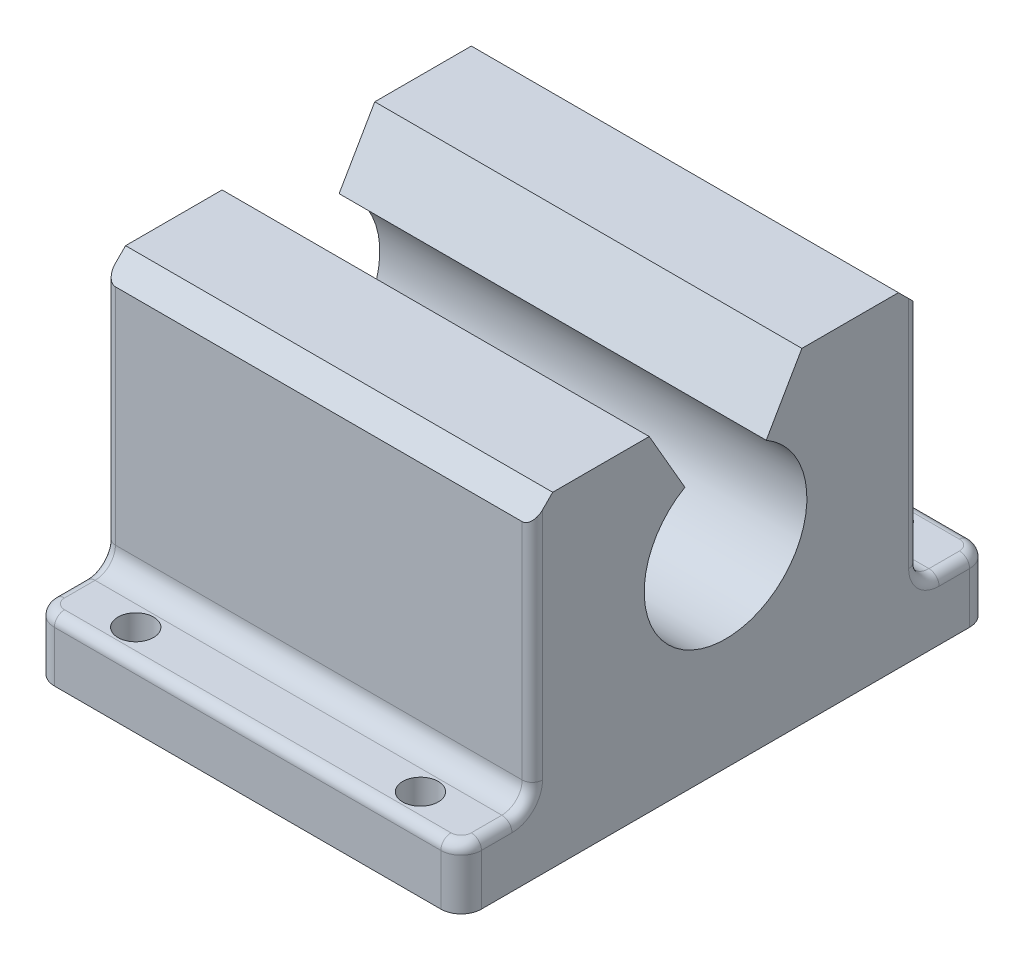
ISO-10303-21;
HEADER;
FILE_DESCRIPTION(('STEP AP214'),'2;1');
FILE_NAME('part.step','',(''),(''),'','','');
FILE_SCHEMA(('AUTOMOTIVE_DESIGN { 1 0 10303 214 1 1 1 1 }'));
ENDSEC;
DATA;
#1=APPLICATION_CONTEXT('core data for automotive mechanical design processes');
#2=APPLICATION_PROTOCOL_DEFINITION('international standard','automotive_design',2000,#1);
#3=PRODUCT_CONTEXT('',#1,'mechanical');
#4=PRODUCT('Part','Part','',(#3));
#5=PRODUCT_RELATED_PRODUCT_CATEGORY('part','',(#4));
#6=PRODUCT_DEFINITION_FORMATION('','',#4);
#7=PRODUCT_DEFINITION_CONTEXT('part definition',#1,'design');
#8=PRODUCT_DEFINITION('design','',#6,#7);
#9=PRODUCT_DEFINITION_SHAPE('','',#8);
#10=(LENGTH_UNIT() NAMED_UNIT(*) SI_UNIT(.MILLI.,.METRE.));
#11=(NAMED_UNIT(*) PLANE_ANGLE_UNIT() SI_UNIT($,.RADIAN.));
#12=(NAMED_UNIT(*) SI_UNIT($,.STERADIAN.) SOLID_ANGLE_UNIT());
#13=UNCERTAINTY_MEASURE_WITH_UNIT(LENGTH_MEASURE(1.E-05),#10,'distance_accuracy_value','');
#14=(GEOMETRIC_REPRESENTATION_CONTEXT(3) GLOBAL_UNCERTAINTY_ASSIGNED_CONTEXT((#13)) GLOBAL_UNIT_ASSIGNED_CONTEXT((#10,
#11,#12)) REPRESENTATION_CONTEXT('',''));
#15=CARTESIAN_POINT('',(0.,0.,0.));
#16=DIRECTION('',(0.,0.,1.));
#17=DIRECTION('',(1.,0.,0.));
#18=AXIS2_PLACEMENT_3D('',#15,#16,#17);
#19=CARTESIAN_POINT('',(66.675,50.8,30.1625));
#20=DIRECTION('',(0.,1.,0.));
#21=DIRECTION('',(0.,0.,1.));
#22=AXIS2_PLACEMENT_3D('',#19,#20,#21);
#23=PLANE('',#22);
#24=DIRECTION('',(0.,0.,-1.));
#25=VECTOR('',#24,1.);
#26=CARTESIAN_POINT('',(66.675,50.8,30.1625));
#27=LINE('',#26,#25);
#28=CARTESIAN_POINT('',(66.675,50.8,-11.9150661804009));
#29=VERTEX_POINT('',#28);
#30=CARTESIAN_POINT('',(66.675,50.8,-26.9874999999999));
#31=VERTEX_POINT('',#30);
#32=EDGE_CURVE('E242',#29,#31,#27,.T.);
#33=ORIENTED_EDGE('',*,*,#32,.T.);
#34=DIRECTION('',(-1.,0.,0.));
#35=VECTOR('',#34,1.);
#36=CARTESIAN_POINT('',(0.,50.8,-26.9874999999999));
#37=LINE('',#36,#35);
#38=CARTESIAN_POINT('',(0.,50.8,-26.9874999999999));
#39=VERTEX_POINT('',#38);
#40=EDGE_CURVE('E285',#31,#39,#37,.T.);
#41=ORIENTED_EDGE('',*,*,#40,.T.);
#42=DIRECTION('',(0.,0.,-1.));
#43=VECTOR('',#42,1.);
#44=CARTESIAN_POINT('',(0.,50.8,30.1625));
#45=LINE('',#44,#43);
#46=CARTESIAN_POINT('',(0.,50.8,-11.9150661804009));
#47=VERTEX_POINT('',#46);
#48=EDGE_CURVE('E245',#47,#39,#45,.T.);
#49=ORIENTED_EDGE('',*,*,#48,.F.);
#50=DIRECTION('',(1.,0.,0.));
#51=VECTOR('',#50,1.);
#52=CARTESIAN_POINT('',(0.,50.8,-11.9150661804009));
#53=LINE('',#52,#51);
#54=EDGE_CURVE('E228',#47,#29,#53,.T.);
#55=ORIENTED_EDGE('',*,*,#54,.T.);
#56=EDGE_LOOP('',(#33,#41,#49,#55));
#57=FACE_BOUND('',#56,.T.);
#58=ADVANCED_FACE('F31',(#57),#23,.T.);
#59=CARTESIAN_POINT('',(66.675,50.8,-41.275));
#60=DIRECTION('',(-1.,0.,0.));
#61=DIRECTION('',(0.,0.,1.));
#62=AXIS2_PLACEMENT_3D('',#59,#60,#61);
#63=PLANE('',#62);
#64=CARTESIAN_POINT('',(66.675,12.7,33.3375));
#65=DIRECTION('',(-1.,0.,0.));
#66=DIRECTION('',(0.,0.,1.));
#67=AXIS2_PLACEMENT_3D('',#64,#65,#66);
#68=CIRCLE('',#67,4.7625);
#69=CARTESIAN_POINT('',(66.675,12.7,28.575));
#70=VERTEX_POINT('',#69);
#71=CARTESIAN_POINT('',(66.675,7.9375,33.3375));
#72=VERTEX_POINT('',#71);
#73=EDGE_CURVE('E39',#70,#72,#68,.T.);
#74=ORIENTED_EDGE('',*,*,#73,.T.);
#75=DIRECTION('',(0.,0.,-1.));
#76=VECTOR('',#75,1.);
#77=CARTESIAN_POINT('',(66.675,7.9375,38.1));
#78=LINE('',#77,#76);
#79=CARTESIAN_POINT('',(66.675,7.9375,38.1));
#80=VERTEX_POINT('',#79);
#81=EDGE_CURVE('E11',#72,#80,#78,.F.);
#82=ORIENTED_EDGE('',*,*,#81,.T.);
#83=DIRECTION('',(0.,1.,0.));
#84=VECTOR('',#83,1.);
#85=CARTESIAN_POINT('',(66.675,0.,38.1));
#86=LINE('',#85,#84);
#87=CARTESIAN_POINT('',(66.675,0.,38.1));
#88=VERTEX_POINT('',#87);
#89=EDGE_CURVE('E325',#80,#88,#86,.F.);
#90=ORIENTED_EDGE('',*,*,#89,.T.);
#91=DIRECTION('',(0.,0.,-1.));
#92=VECTOR('',#91,1.);
#93=CARTESIAN_POINT('',(66.675,0.,41.275));
#94=LINE('',#93,#92);
#95=CARTESIAN_POINT('',(66.675,0.,-38.1));
#96=VERTEX_POINT('',#95);
#97=EDGE_CURVE('E255',#88,#96,#94,.T.);
#98=ORIENTED_EDGE('',*,*,#97,.T.);
#99=DIRECTION('',(0.,1.,0.));
#100=VECTOR('',#99,1.);
#101=CARTESIAN_POINT('',(66.675,50.8,-38.1));
#102=LINE('',#101,#100);
#103=CARTESIAN_POINT('',(66.675,7.9375,-38.1));
#104=VERTEX_POINT('',#103);
#105=EDGE_CURVE('E327',#96,#104,#102,.T.);
#106=ORIENTED_EDGE('',*,*,#105,.T.);
#107=DIRECTION('',(0.,0.,1.));
#108=VECTOR('',#107,1.);
#109=CARTESIAN_POINT('',(66.675,7.9375,-41.275));
#110=LINE('',#109,#108);
#111=CARTESIAN_POINT('',(66.675,7.9375,-33.3375));
#112=VERTEX_POINT('',#111);
#113=EDGE_CURVE('E404',#104,#112,#110,.T.);
#114=ORIENTED_EDGE('',*,*,#113,.T.);
#115=CARTESIAN_POINT('',(66.675,12.7,-33.3375));
#116=DIRECTION('',(-1.,0.,0.));
#117=DIRECTION('',(0.,0.,1.));
#118=AXIS2_PLACEMENT_3D('',#115,#116,#117);
#119=CIRCLE('',#118,4.7625);
#120=CARTESIAN_POINT('',(66.675,12.7,-28.575));
#121=VERTEX_POINT('',#120);
#122=EDGE_CURVE('E402',#112,#121,#119,.T.);
#123=ORIENTED_EDGE('',*,*,#122,.T.);
#124=DIRECTION('',(0.,1.,0.));
#125=VECTOR('',#124,1.);
#126=CARTESIAN_POINT('',(66.675,50.8,-28.575));
#127=LINE('',#126,#125);
#128=CARTESIAN_POINT('',(66.675,49.2125,-28.575));
#129=VERTEX_POINT('',#128);
#130=EDGE_CURVE('E400',#121,#129,#127,.T.);
#131=ORIENTED_EDGE('',*,*,#130,.T.);
#132=DIRECTION('',(0.,0.707106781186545,0.707106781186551));
#133=VECTOR('',#132,1.);
#134=CARTESIAN_POINT('',(66.675,50.8,-26.9874999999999));
#135=LINE('',#134,#133);
#136=EDGE_CURVE('E251',#129,#31,#135,.T.);
#137=ORIENTED_EDGE('',*,*,#136,.T.);
#138=ORIENTED_EDGE('',*,*,#32,.F.);
#139=DIRECTION('',(0.,-0.866025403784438,0.500000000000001));
#140=VECTOR('',#139,1.);
#141=CARTESIAN_POINT('',(66.675,50.8,-11.9150661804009));
#142=LINE('',#141,#140);
#143=CARTESIAN_POINT('',(66.675,41.1610226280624,-6.35000000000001));
#144=VERTEX_POINT('',#143);
#145=EDGE_CURVE('E225',#29,#144,#142,.T.);
#146=ORIENTED_EDGE('',*,*,#145,.T.);
#147=CARTESIAN_POINT('',(66.675,30.1625,0.));
#148=DIRECTION('',(1.,0.,0.));
#149=DIRECTION('',(0.,0.,-1.));
#150=AXIS2_PLACEMENT_3D('',#147,#148,#149);
#151=CIRCLE('',#150,12.7);
#152=CARTESIAN_POINT('',(66.675,41.1610226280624,6.35000000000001));
#153=VERTEX_POINT('',#152);
#154=EDGE_CURVE('E488',#153,#144,#151,.T.);
#155=ORIENTED_EDGE('',*,*,#154,.F.);
#156=DIRECTION('',(0.,-0.866025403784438,-0.500000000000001));
#157=VECTOR('',#156,1.);
#158=CARTESIAN_POINT('',(66.675,50.8,11.9150661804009));
#159=LINE('',#158,#157);
#160=CARTESIAN_POINT('',(66.675,50.8,11.9150661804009));
#161=VERTEX_POINT('',#160);
#162=EDGE_CURVE('E236',#161,#153,#159,.T.);
#163=ORIENTED_EDGE('',*,*,#162,.F.);
#164=CARTESIAN_POINT('',(66.675,50.8,26.9875));
#165=VERTEX_POINT('',#164);
#166=EDGE_CURVE('E252',#165,#161,#27,.T.);
#167=ORIENTED_EDGE('',*,*,#166,.F.);
#168=DIRECTION('',(0.,0.707106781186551,-0.707106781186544));
#169=VECTOR('',#168,1.);
#170=CARTESIAN_POINT('',(66.675,47.6249999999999,30.1625));
#171=LINE('',#170,#169);
#172=CARTESIAN_POINT('',(66.675,49.2125,28.575));
#173=VERTEX_POINT('',#172);
#174=EDGE_CURVE('E283',#165,#173,#171,.F.);
#175=ORIENTED_EDGE('',*,*,#174,.T.);
#176=DIRECTION('',(0.,1.,0.));
#177=VECTOR('',#176,1.);
#178=CARTESIAN_POINT('',(66.675,12.7,28.575));
#179=LINE('',#178,#177);
#180=EDGE_CURVE('E49',#173,#70,#179,.F.);
#181=ORIENTED_EDGE('',*,*,#180,.T.);
#182=EDGE_LOOP('',(#74,#82,#90,#98,#106,#114,#123,#131,#137,#138,#146,#155,#163,#167,#175,#181));
#183=FACE_BOUND('',#182,.T.);
#184=ADVANCED_FACE('F249',(#183),#63,.F.);
#185=CARTESIAN_POINT('',(0.,50.8,-41.275));
#186=DIRECTION('',(-1.,0.,0.));
#187=DIRECTION('',(0.,0.,1.));
#188=AXIS2_PLACEMENT_3D('',#185,#186,#187);
#189=PLANE('',#188);
#190=CARTESIAN_POINT('',(0.,12.7,33.3375));
#191=DIRECTION('',(-1.,0.,0.));
#192=DIRECTION('',(0.,0.,1.));
#193=AXIS2_PLACEMENT_3D('',#190,#191,#192);
#194=CIRCLE('',#193,4.7625);
#195=CARTESIAN_POINT('',(0.,7.93750000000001,33.3375));
#196=VERTEX_POINT('',#195);
#197=CARTESIAN_POINT('',(0.,12.7,28.575));
#198=VERTEX_POINT('',#197);
#199=EDGE_CURVE('E338',#196,#198,#194,.F.);
#200=ORIENTED_EDGE('',*,*,#199,.T.);
#201=DIRECTION('',(0.,1.,0.));
#202=VECTOR('',#201,1.);
#203=CARTESIAN_POINT('',(0.,50.8,28.575));
#204=LINE('',#203,#202);
#205=CARTESIAN_POINT('',(0.,49.2125,28.575));
#206=VERTEX_POINT('',#205);
#207=EDGE_CURVE('E340',#198,#206,#204,.T.);
#208=ORIENTED_EDGE('',*,*,#207,.T.);
#209=DIRECTION('',(0.,-0.707106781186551,0.707106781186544));
#210=VECTOR('',#209,1.);
#211=CARTESIAN_POINT('',(0.,84.93125,-7.14374999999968));
#212=LINE('',#211,#210);
#213=CARTESIAN_POINT('',(0.,50.8,26.9875));
#214=VERTEX_POINT('',#213);
#215=EDGE_CURVE('E278',#206,#214,#212,.F.);
#216=ORIENTED_EDGE('',*,*,#215,.T.);
#217=CARTESIAN_POINT('',(0.,50.8,11.9150661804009));
#218=VERTEX_POINT('',#217);
#219=EDGE_CURVE('E257',#214,#218,#45,.T.);
#220=ORIENTED_EDGE('',*,*,#219,.T.);
#221=DIRECTION('',(0.,-0.866025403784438,-0.500000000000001));
#222=VECTOR('',#221,1.);
#223=CARTESIAN_POINT('',(0.,50.8,11.9150661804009));
#224=LINE('',#223,#222);
#225=CARTESIAN_POINT('',(0.,41.1610226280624,6.35000000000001));
#226=VERTEX_POINT('',#225);
#227=EDGE_CURVE('E235',#218,#226,#224,.T.);
#228=ORIENTED_EDGE('',*,*,#227,.T.);
#229=CARTESIAN_POINT('',(0.,30.1625,0.));
#230=DIRECTION('',(1.,0.,0.));
#231=DIRECTION('',(0.,0.,-1.));
#232=AXIS2_PLACEMENT_3D('',#229,#230,#231);
#233=CIRCLE('',#232,12.7);
#234=CARTESIAN_POINT('',(0.,41.1610226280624,-6.35000000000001));
#235=VERTEX_POINT('',#234);
#236=EDGE_CURVE('E485',#226,#235,#233,.T.);
#237=ORIENTED_EDGE('',*,*,#236,.T.);
#238=DIRECTION('',(0.,-0.866025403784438,0.500000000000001));
#239=VECTOR('',#238,1.);
#240=CARTESIAN_POINT('',(0.,50.8,-11.9150661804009));
#241=LINE('',#240,#239);
#242=EDGE_CURVE('E247',#47,#235,#241,.T.);
#243=ORIENTED_EDGE('',*,*,#242,.F.);
#244=ORIENTED_EDGE('',*,*,#48,.T.);
#245=DIRECTION('',(0.,-0.707106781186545,-0.707106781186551));
#246=VECTOR('',#245,1.);
#247=CARTESIAN_POINT('',(0.,43.65625,-34.13125));
#248=LINE('',#247,#246);
#249=CARTESIAN_POINT('',(0.,49.2125,-28.575));
#250=VERTEX_POINT('',#249);
#251=EDGE_CURVE('E275',#39,#250,#248,.T.);
#252=ORIENTED_EDGE('',*,*,#251,.T.);
#253=DIRECTION('',(0.,1.,0.));
#254=VECTOR('',#253,1.);
#255=CARTESIAN_POINT('',(0.,12.7,-28.575));
#256=LINE('',#255,#254);
#257=CARTESIAN_POINT('',(0.,12.7,-28.575));
#258=VERTEX_POINT('',#257);
#259=EDGE_CURVE('E334',#250,#258,#256,.F.);
#260=ORIENTED_EDGE('',*,*,#259,.T.);
#261=CARTESIAN_POINT('',(0.,12.7,-33.3375));
#262=DIRECTION('',(-1.,0.,0.));
#263=DIRECTION('',(0.,0.,1.));
#264=AXIS2_PLACEMENT_3D('',#261,#262,#263);
#265=CIRCLE('',#264,4.7625);
#266=CARTESIAN_POINT('',(0.,7.9375,-33.3375));
#267=VERTEX_POINT('',#266);
#268=EDGE_CURVE('E332',#258,#267,#265,.F.);
#269=ORIENTED_EDGE('',*,*,#268,.T.);
#270=DIRECTION('',(0.,0.,1.));
#271=VECTOR('',#270,1.);
#272=CARTESIAN_POINT('',(0.,7.9375,-38.1));
#273=LINE('',#272,#271);
#274=CARTESIAN_POINT('',(0.,7.9375,-38.1));
#275=VERTEX_POINT('',#274);
#276=EDGE_CURVE('E330',#267,#275,#273,.F.);
#277=ORIENTED_EDGE('',*,*,#276,.T.);
#278=DIRECTION('',(0.,1.,0.));
#279=VECTOR('',#278,1.);
#280=CARTESIAN_POINT('',(0.,0.,-38.1));
#281=LINE('',#280,#279);
#282=CARTESIAN_POINT('',(0.,0.,-38.1));
#283=VERTEX_POINT('',#282);
#284=EDGE_CURVE('E302',#275,#283,#281,.F.);
#285=ORIENTED_EDGE('',*,*,#284,.T.);
#286=DIRECTION('',(0.,0.,-1.));
#287=VECTOR('',#286,1.);
#288=CARTESIAN_POINT('',(0.,0.,41.275));
#289=LINE('',#288,#287);
#290=CARTESIAN_POINT('',(0.,0.,38.1));
#291=VERTEX_POINT('',#290);
#292=EDGE_CURVE('E253',#291,#283,#289,.T.);
#293=ORIENTED_EDGE('',*,*,#292,.F.);
#294=DIRECTION('',(0.,1.,0.));
#295=VECTOR('',#294,1.);
#296=CARTESIAN_POINT('',(0.,50.8,38.1));
#297=LINE('',#296,#295);
#298=CARTESIAN_POINT('',(0.,7.9375,38.1));
#299=VERTEX_POINT('',#298);
#300=EDGE_CURVE('E304',#291,#299,#297,.T.);
#301=ORIENTED_EDGE('',*,*,#300,.T.);
#302=DIRECTION('',(0.,0.,-1.));
#303=VECTOR('',#302,1.);
#304=CARTESIAN_POINT('',(0.,7.93750000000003,-41.275));
#305=LINE('',#304,#303);
#306=EDGE_CURVE('E336',#299,#196,#305,.T.);
#307=ORIENTED_EDGE('',*,*,#306,.T.);
#308=EDGE_LOOP('',(#200,#208,#216,#220,#228,#237,#243,#244,#252,#260,#269,#277,#285,#293,#301,#307));
#309=FACE_BOUND('',#308,.T.);
#310=ADVANCED_FACE('F492',(#309),#189,.T.);
#311=CARTESIAN_POINT('',(66.675,0.,-41.275));
#312=DIRECTION('',(0.,0.,1.));
#313=DIRECTION('',(1.,0.,0.));
#314=AXIS2_PLACEMENT_3D('',#311,#312,#313);
#315=PLANE('',#314);
#316=DIRECTION('',(0.,1.,0.));
#317=VECTOR('',#316,1.);
#318=CARTESIAN_POINT('',(3.175,9.525,-41.275));
#319=LINE('',#318,#317);
#320=CARTESIAN_POINT('',(3.175,0.,-41.275));
#321=VERTEX_POINT('',#320);
#322=CARTESIAN_POINT('',(3.175,7.9375,-41.275));
#323=VERTEX_POINT('',#322);
#324=EDGE_CURVE('E322',#321,#323,#319,.T.);
#325=ORIENTED_EDGE('',*,*,#324,.T.);
#326=DIRECTION('',(-1.,0.,0.));
#327=VECTOR('',#326,1.);
#328=CARTESIAN_POINT('',(66.675,7.9375,-41.275));
#329=LINE('',#328,#327);
#330=CARTESIAN_POINT('',(63.5,7.9375,-41.275));
#331=VERTEX_POINT('',#330);
#332=EDGE_CURVE('E394',#323,#331,#329,.F.);
#333=ORIENTED_EDGE('',*,*,#332,.T.);
#334=DIRECTION('',(0.,1.,0.));
#335=VECTOR('',#334,1.);
#336=CARTESIAN_POINT('',(63.5,0.,-41.275));
#337=LINE('',#336,#335);
#338=CARTESIAN_POINT('',(63.5,0.,-41.275));
#339=VERTEX_POINT('',#338);
#340=EDGE_CURVE('E320',#331,#339,#337,.F.);
#341=ORIENTED_EDGE('',*,*,#340,.T.);
#342=DIRECTION('',(-1.,0.,0.));
#343=VECTOR('',#342,1.);
#344=CARTESIAN_POINT('',(66.675,0.,-41.275));
#345=LINE('',#344,#343);
#346=EDGE_CURVE('E263',#339,#321,#345,.T.);
#347=ORIENTED_EDGE('',*,*,#346,.T.);
#348=EDGE_LOOP('',(#325,#333,#341,#347));
#349=FACE_BOUND('',#348,.T.);
#350=ADVANCED_FACE('F33',(#349),#315,.F.);
#351=CARTESIAN_POINT('',(66.675,9.525,-41.275));
#352=DIRECTION('',(0.,-1.,0.));
#353=DIRECTION('',(0.,0.,-1.));
#354=AXIS2_PLACEMENT_3D('',#351,#352,#353);
#355=PLANE('',#354);
#356=CARTESIAN_POINT('',(11.1125,9.525,-36.5125));
#357=DIRECTION('',(0.,1.,0.));
#358=DIRECTION('',(0.,0.,1.));
#359=AXIS2_PLACEMENT_3D('',#356,#357,#358);
#360=CIRCLE('',#359,2.778125);
#361=CARTESIAN_POINT('',(11.1125,9.525,-33.734375));
#362=VERTEX_POINT('',#361);
#363=EDGE_CURVE('E460',#362,#362,#360,.T.);
#364=ORIENTED_EDGE('',*,*,#363,.F.);
#365=EDGE_LOOP('',(#364));
#366=FACE_BOUND('',#365,.T.);
#367=CARTESIAN_POINT('',(55.5625,9.525,-36.5125));
#368=DIRECTION('',(0.,1.,0.));
#369=DIRECTION('',(0.,0.,1.));
#370=AXIS2_PLACEMENT_3D('',#367,#368,#369);
#371=CIRCLE('',#370,2.778125);
#372=CARTESIAN_POINT('',(55.5625,9.525,-33.734375));
#373=VERTEX_POINT('',#372);
#374=EDGE_CURVE('E473',#373,#373,#371,.T.);
#375=ORIENTED_EDGE('',*,*,#374,.F.);
#376=EDGE_LOOP('',(#375));
#377=FACE_BOUND('',#376,.T.);
#378=CARTESIAN_POINT('',(3.175,9.525,-38.1));
#379=DIRECTION('',(0.,-1.,0.));
#380=DIRECTION('',(0.,0.,-1.));
#381=AXIS2_PLACEMENT_3D('',#378,#379,#380);
#382=CIRCLE('',#381,1.5875);
#383=CARTESIAN_POINT('',(3.175,9.525,-39.6875));
#384=VERTEX_POINT('',#383);
#385=CARTESIAN_POINT('',(1.5875,9.525,-38.1));
#386=VERTEX_POINT('',#385);
#387=EDGE_CURVE('E384',#384,#386,#382,.F.);
#388=ORIENTED_EDGE('',*,*,#387,.T.);
#389=DIRECTION('',(0.,0.,1.));
#390=VECTOR('',#389,1.);
#391=CARTESIAN_POINT('',(1.58750000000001,9.525,-33.3375));
#392=LINE('',#391,#390);
#393=CARTESIAN_POINT('',(1.58750000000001,9.525,-33.3375));
#394=VERTEX_POINT('',#393);
#395=EDGE_CURVE('E386',#386,#394,#392,.T.);
#396=ORIENTED_EDGE('',*,*,#395,.T.);
#397=DIRECTION('',(-1.,0.,0.));
#398=VECTOR('',#397,1.);
#399=CARTESIAN_POINT('',(66.675,9.525,-33.3375));
#400=LINE('',#399,#398);
#401=CARTESIAN_POINT('',(65.0875,9.525,-33.3375));
#402=VERTEX_POINT('',#401);
#403=EDGE_CURVE('E293',#394,#402,#400,.F.);
#404=ORIENTED_EDGE('',*,*,#403,.T.);
#405=DIRECTION('',(0.,0.,1.));
#406=VECTOR('',#405,1.);
#407=CARTESIAN_POINT('',(65.0875,9.525,-41.275));
#408=LINE('',#407,#406);
#409=CARTESIAN_POINT('',(65.0875,9.525,-38.1));
#410=VERTEX_POINT('',#409);
#411=EDGE_CURVE('E378',#402,#410,#408,.F.);
#412=ORIENTED_EDGE('',*,*,#411,.T.);
#413=CARTESIAN_POINT('',(63.5,9.525,-38.1));
#414=DIRECTION('',(0.,-1.,0.));
#415=DIRECTION('',(0.,0.,-1.));
#416=AXIS2_PLACEMENT_3D('',#413,#414,#415);
#417=CIRCLE('',#416,1.5875);
#418=CARTESIAN_POINT('',(63.5,9.525,-39.6875));
#419=VERTEX_POINT('',#418);
#420=EDGE_CURVE('E380',#410,#419,#417,.F.);
#421=ORIENTED_EDGE('',*,*,#420,.T.);
#422=DIRECTION('',(-1.,0.,0.));
#423=VECTOR('',#422,1.);
#424=CARTESIAN_POINT('',(66.675,9.525,-39.6875));
#425=LINE('',#424,#423);
#426=EDGE_CURVE('E382',#419,#384,#425,.T.);
#427=ORIENTED_EDGE('',*,*,#426,.T.);
#428=EDGE_LOOP('',(#388,#396,#404,#412,#421,#427));
#429=FACE_BOUND('',#428,.T.);
#430=ADVANCED_FACE('F606',(#366,#377,#429),#355,.F.);
#431=CARTESIAN_POINT('',(66.675,9.525,-30.1625));
#432=DIRECTION('',(0.,0.,1.));
#433=DIRECTION('',(1.,0.,0.));
#434=AXIS2_PLACEMENT_3D('',#431,#432,#433);
#435=PLANE('',#434);
#436=DIRECTION('',(-1.,0.,0.));
#437=VECTOR('',#436,1.);
#438=CARTESIAN_POINT('',(0.,12.7,-30.1625));
#439=LINE('',#438,#437);
#440=CARTESIAN_POINT('',(65.0875,12.7,-30.1625));
#441=VERTEX_POINT('',#440);
#442=CARTESIAN_POINT('',(1.5875,12.7,-30.1625));
#443=VERTEX_POINT('',#442);
#444=EDGE_CURVE('E290',#441,#443,#439,.T.);
#445=ORIENTED_EDGE('',*,*,#444,.T.);
#446=DIRECTION('',(0.,1.,0.));
#447=VECTOR('',#446,1.);
#448=CARTESIAN_POINT('',(1.58750000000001,47.625,-30.1625));
#449=LINE('',#448,#447);
#450=CARTESIAN_POINT('',(1.58750000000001,47.625,-30.1625));
#451=VERTEX_POINT('',#450);
#452=EDGE_CURVE('E353',#443,#451,#449,.T.);
#453=ORIENTED_EDGE('',*,*,#452,.T.);
#454=DIRECTION('',(1.,0.,0.));
#455=VECTOR('',#454,1.);
#456=CARTESIAN_POINT('',(66.675,47.625,-30.1625));
#457=LINE('',#456,#455);
#458=CARTESIAN_POINT('',(65.0875,47.625,-30.1625));
#459=VERTEX_POINT('',#458);
#460=EDGE_CURVE('E287',#451,#459,#457,.T.);
#461=ORIENTED_EDGE('',*,*,#460,.T.);
#462=DIRECTION('',(0.,1.,0.));
#463=VECTOR('',#462,1.);
#464=CARTESIAN_POINT('',(65.0875,9.525,-30.1625));
#465=LINE('',#464,#463);
#466=EDGE_CURVE('E351',#459,#441,#465,.F.);
#467=ORIENTED_EDGE('',*,*,#466,.T.);
#468=EDGE_LOOP('',(#445,#453,#461,#467));
#469=FACE_BOUND('',#468,.T.);
#470=ADVANCED_FACE('F618',(#469),#435,.F.);
#471=ORIENTED_EDGE('',*,*,#219,.F.);
#472=DIRECTION('',(1.,0.,0.));
#473=VECTOR('',#472,1.);
#474=CARTESIAN_POINT('',(66.675,50.8,26.9875));
#475=LINE('',#474,#473);
#476=EDGE_CURVE('E280',#214,#165,#475,.T.);
#477=ORIENTED_EDGE('',*,*,#476,.T.);
#478=ORIENTED_EDGE('',*,*,#166,.T.);
#479=DIRECTION('',(1.,0.,0.));
#480=VECTOR('',#479,1.);
#481=CARTESIAN_POINT('',(0.,50.8,11.9150661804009));
#482=LINE('',#481,#480);
#483=EDGE_CURVE('E246',#218,#161,#482,.T.);
#484=ORIENTED_EDGE('',*,*,#483,.F.);
#485=EDGE_LOOP('',(#471,#477,#478,#484));
#486=FACE_BOUND('',#485,.T.);
#487=ADVANCED_FACE('F505',(#486),#23,.T.);
#488=CARTESIAN_POINT('',(66.675,9.525,30.1625));
#489=DIRECTION('',(0.,0.,1.));
#490=DIRECTION('',(1.,0.,0.));
#491=AXIS2_PLACEMENT_3D('',#488,#489,#490);
#492=PLANE('',#491);
#493=DIRECTION('',(-1.,0.,0.));
#494=VECTOR('',#493,1.);
#495=CARTESIAN_POINT('',(66.675,47.6249999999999,30.1625));
#496=LINE('',#495,#494);
#497=CARTESIAN_POINT('',(65.0875,47.6249999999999,30.1625));
#498=VERTEX_POINT('',#497);
#499=CARTESIAN_POINT('',(1.5875,47.6249999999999,30.1625));
#500=VERTEX_POINT('',#499);
#501=EDGE_CURVE('E272',#498,#500,#496,.T.);
#502=ORIENTED_EDGE('',*,*,#501,.T.);
#503=DIRECTION('',(0.,1.,0.));
#504=VECTOR('',#503,1.);
#505=CARTESIAN_POINT('',(1.58750000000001,9.525,30.1625));
#506=LINE('',#505,#504);
#507=CARTESIAN_POINT('',(1.5875,12.7,30.1625));
#508=VERTEX_POINT('',#507);
#509=EDGE_CURVE('E349',#500,#508,#506,.F.);
#510=ORIENTED_EDGE('',*,*,#509,.T.);
#511=DIRECTION('',(-1.,0.,0.));
#512=VECTOR('',#511,1.);
#513=CARTESIAN_POINT('',(66.675,12.7,30.1625));
#514=LINE('',#513,#512);
#515=CARTESIAN_POINT('',(65.0875,12.7,30.1625));
#516=VERTEX_POINT('',#515);
#517=EDGE_CURVE('E299',#508,#516,#514,.F.);
#518=ORIENTED_EDGE('',*,*,#517,.T.);
#519=DIRECTION('',(0.,1.,0.));
#520=VECTOR('',#519,1.);
#521=CARTESIAN_POINT('',(65.0875,47.6249999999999,30.1625));
#522=LINE('',#521,#520);
#523=EDGE_CURVE('E347',#516,#498,#522,.T.);
#524=ORIENTED_EDGE('',*,*,#523,.T.);
#525=EDGE_LOOP('',(#502,#510,#518,#524));
#526=FACE_BOUND('',#525,.T.);
#527=ADVANCED_FACE('F625',(#526),#492,.T.);
#528=CARTESIAN_POINT('',(66.675,9.525,41.275));
#529=DIRECTION('',(0.,1.,0.));
#530=DIRECTION('',(0.,0.,1.));
#531=AXIS2_PLACEMENT_3D('',#528,#529,#530);
#532=PLANE('',#531);
#533=CARTESIAN_POINT('',(11.1125,9.525,36.5125));
#534=DIRECTION('',(0.,1.,0.));
#535=DIRECTION('',(0.,0.,1.));
#536=AXIS2_PLACEMENT_3D('',#533,#534,#535);
#537=CIRCLE('',#536,2.778125);
#538=CARTESIAN_POINT('',(11.1125,9.525,39.290625));
#539=VERTEX_POINT('',#538);
#540=EDGE_CURVE('E467',#539,#539,#537,.T.);
#541=ORIENTED_EDGE('',*,*,#540,.F.);
#542=EDGE_LOOP('',(#541));
#543=FACE_BOUND('',#542,.T.);
#544=CARTESIAN_POINT('',(55.5625,9.525,36.5125));
#545=DIRECTION('',(0.,1.,0.));
#546=DIRECTION('',(0.,0.,1.));
#547=AXIS2_PLACEMENT_3D('',#544,#545,#546);
#548=CIRCLE('',#547,2.778125);
#549=CARTESIAN_POINT('',(55.5625,9.525,39.290625));
#550=VERTEX_POINT('',#549);
#551=EDGE_CURVE('E479',#550,#550,#548,.T.);
#552=ORIENTED_EDGE('',*,*,#551,.F.);
#553=EDGE_LOOP('',(#552));
#554=FACE_BOUND('',#553,.T.);
#555=DIRECTION('',(-1.,0.,0.));
#556=VECTOR('',#555,1.);
#557=CARTESIAN_POINT('',(0.,9.525,33.3375));
#558=LINE('',#557,#556);
#559=CARTESIAN_POINT('',(65.0875,9.525,33.3375));
#560=VERTEX_POINT('',#559);
#561=CARTESIAN_POINT('',(1.5875,9.525,33.3375));
#562=VERTEX_POINT('',#561);
#563=EDGE_CURVE('E296',#560,#562,#558,.T.);
#564=ORIENTED_EDGE('',*,*,#563,.T.);
#565=DIRECTION('',(0.,0.,-1.));
#566=VECTOR('',#565,1.);
#567=CARTESIAN_POINT('',(1.58750000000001,9.525,41.275));
#568=LINE('',#567,#566);
#569=CARTESIAN_POINT('',(1.5875,9.525,38.1));
#570=VERTEX_POINT('',#569);
#571=EDGE_CURVE('E376',#562,#570,#568,.F.);
#572=ORIENTED_EDGE('',*,*,#571,.T.);
#573=CARTESIAN_POINT('',(3.175,9.525,38.1));
#574=DIRECTION('',(0.,1.,0.));
#575=DIRECTION('',(0.,0.,1.));
#576=AXIS2_PLACEMENT_3D('',#573,#574,#575);
#577=CIRCLE('',#576,1.5875);
#578=CARTESIAN_POINT('',(3.175,9.525,39.6875));
#579=VERTEX_POINT('',#578);
#580=EDGE_CURVE('E374',#570,#579,#577,.T.);
#581=ORIENTED_EDGE('',*,*,#580,.T.);
#582=DIRECTION('',(-1.,0.,0.));
#583=VECTOR('',#582,1.);
#584=CARTESIAN_POINT('',(66.675,9.525,39.6875));
#585=LINE('',#584,#583);
#586=CARTESIAN_POINT('',(63.5,9.525,39.6875));
#587=VERTEX_POINT('',#586);
#588=EDGE_CURVE('E372',#579,#587,#585,.F.);
#589=ORIENTED_EDGE('',*,*,#588,.T.);
#590=CARTESIAN_POINT('',(63.5,9.525,38.1));
#591=DIRECTION('',(0.,1.,0.));
#592=DIRECTION('',(0.,0.,1.));
#593=AXIS2_PLACEMENT_3D('',#590,#591,#592);
#594=CIRCLE('',#593,1.5875);
#595=CARTESIAN_POINT('',(65.0875,9.525,38.1));
#596=VERTEX_POINT('',#595);
#597=EDGE_CURVE('E370',#587,#596,#594,.T.);
#598=ORIENTED_EDGE('',*,*,#597,.T.);
#599=DIRECTION('',(0.,0.,-1.));
#600=VECTOR('',#599,1.);
#601=CARTESIAN_POINT('',(65.0875,9.525,33.3375));
#602=LINE('',#601,#600);
#603=EDGE_CURVE('E368',#596,#560,#602,.T.);
#604=ORIENTED_EDGE('',*,*,#603,.T.);
#605=EDGE_LOOP('',(#564,#572,#581,#589,#598,#604));
#606=FACE_BOUND('',#605,.T.);
#607=ADVANCED_FACE('F636',(#543,#554,#606),#532,.T.);
#608=CARTESIAN_POINT('',(66.675,0.,41.275));
#609=DIRECTION('',(0.,0.,1.));
#610=DIRECTION('',(1.,0.,0.));
#611=AXIS2_PLACEMENT_3D('',#608,#609,#610);
#612=PLANE('',#611);
#613=DIRECTION('',(0.,1.,0.));
#614=VECTOR('',#613,1.);
#615=CARTESIAN_POINT('',(63.5,9.525,41.275));
#616=LINE('',#615,#614);
#617=CARTESIAN_POINT('',(63.5,0.,41.275));
#618=VERTEX_POINT('',#617);
#619=CARTESIAN_POINT('',(63.5,7.9375,41.275));
#620=VERTEX_POINT('',#619);
#621=EDGE_CURVE('E307',#618,#620,#616,.T.);
#622=ORIENTED_EDGE('',*,*,#621,.T.);
#623=DIRECTION('',(-1.,0.,0.));
#624=VECTOR('',#623,1.);
#625=CARTESIAN_POINT('',(66.675,7.9375,41.275));
#626=LINE('',#625,#624);
#627=CARTESIAN_POINT('',(3.175,7.9375,41.275));
#628=VERTEX_POINT('',#627);
#629=EDGE_CURVE('E392',#620,#628,#626,.T.);
#630=ORIENTED_EDGE('',*,*,#629,.T.);
#631=DIRECTION('',(0.,1.,0.));
#632=VECTOR('',#631,1.);
#633=CARTESIAN_POINT('',(3.175,0.,41.275));
#634=LINE('',#633,#632);
#635=CARTESIAN_POINT('',(3.175,0.,41.275));
#636=VERTEX_POINT('',#635);
#637=EDGE_CURVE('E310',#628,#636,#634,.F.);
#638=ORIENTED_EDGE('',*,*,#637,.T.);
#639=DIRECTION('',(-1.,0.,0.));
#640=VECTOR('',#639,1.);
#641=CARTESIAN_POINT('',(66.675,0.,41.275));
#642=LINE('',#641,#640);
#643=EDGE_CURVE('E266',#618,#636,#642,.T.);
#644=ORIENTED_EDGE('',*,*,#643,.F.);
#645=EDGE_LOOP('',(#622,#630,#638,#644));
#646=FACE_BOUND('',#645,.T.);
#647=ADVANCED_FACE('F535',(#646),#612,.T.);
#648=CARTESIAN_POINT('',(66.675,0.,41.275));
#649=DIRECTION('',(0.,1.,0.));
#650=DIRECTION('',(0.,0.,1.));
#651=AXIS2_PLACEMENT_3D('',#648,#649,#650);
#652=PLANE('',#651);
#653=CARTESIAN_POINT('',(11.1125,0.,-36.5125));
#654=DIRECTION('',(0.,1.,0.));
#655=DIRECTION('',(0.,0.,1.));
#656=AXIS2_PLACEMENT_3D('',#653,#654,#655);
#657=CIRCLE('',#656,2.778125);
#658=CARTESIAN_POINT('',(11.1125,0.,-33.734375));
#659=VERTEX_POINT('',#658);
#660=EDGE_CURVE('E464',#659,#659,#657,.T.);
#661=ORIENTED_EDGE('',*,*,#660,.T.);
#662=EDGE_LOOP('',(#661));
#663=FACE_BOUND('',#662,.T.);
#664=CARTESIAN_POINT('',(11.1125,0.,36.5125));
#665=DIRECTION('',(0.,1.,0.));
#666=DIRECTION('',(0.,0.,1.));
#667=AXIS2_PLACEMENT_3D('',#664,#665,#666);
#668=CIRCLE('',#667,2.778125);
#669=CARTESIAN_POINT('',(11.1125,0.,39.290625));
#670=VERTEX_POINT('',#669);
#671=EDGE_CURVE('E470',#670,#670,#668,.T.);
#672=ORIENTED_EDGE('',*,*,#671,.T.);
#673=EDGE_LOOP('',(#672));
#674=FACE_BOUND('',#673,.T.);
#675=CARTESIAN_POINT('',(55.5625,0.,-36.5125));
#676=DIRECTION('',(0.,1.,0.));
#677=DIRECTION('',(0.,0.,1.));
#678=AXIS2_PLACEMENT_3D('',#675,#676,#677);
#679=CIRCLE('',#678,2.778125);
#680=CARTESIAN_POINT('',(55.5625,0.,-33.734375));
#681=VERTEX_POINT('',#680);
#682=EDGE_CURVE('E476',#681,#681,#679,.T.);
#683=ORIENTED_EDGE('',*,*,#682,.T.);
#684=EDGE_LOOP('',(#683));
#685=FACE_BOUND('',#684,.T.);
#686=CARTESIAN_POINT('',(55.5625,0.,36.5125));
#687=DIRECTION('',(0.,1.,0.));
#688=DIRECTION('',(0.,0.,1.));
#689=AXIS2_PLACEMENT_3D('',#686,#687,#688);
#690=CIRCLE('',#689,2.778125);
#691=CARTESIAN_POINT('',(55.5625,0.,39.290625));
#692=VERTEX_POINT('',#691);
#693=EDGE_CURVE('E482',#692,#692,#690,.T.);
#694=ORIENTED_EDGE('',*,*,#693,.T.);
#695=EDGE_LOOP('',(#694));
#696=FACE_BOUND('',#695,.T.);
#697=ORIENTED_EDGE('',*,*,#643,.T.);
#698=CARTESIAN_POINT('',(3.175,0.,38.1));
#699=DIRECTION('',(0.,1.,0.));
#700=DIRECTION('',(0.,0.,1.));
#701=AXIS2_PLACEMENT_3D('',#698,#699,#700);
#702=CIRCLE('',#701,3.175);
#703=EDGE_CURVE('E318',#636,#291,#702,.F.);
#704=ORIENTED_EDGE('',*,*,#703,.T.);
#705=ORIENTED_EDGE('',*,*,#292,.T.);
#706=CARTESIAN_POINT('',(3.175,0.,-38.1));
#707=DIRECTION('',(0.,1.,0.));
#708=DIRECTION('',(0.,0.,1.));
#709=AXIS2_PLACEMENT_3D('',#706,#707,#708);
#710=CIRCLE('',#709,3.175);
#711=EDGE_CURVE('E316',#283,#321,#710,.F.);
#712=ORIENTED_EDGE('',*,*,#711,.T.);
#713=ORIENTED_EDGE('',*,*,#346,.F.);
#714=CARTESIAN_POINT('',(63.5,0.,-38.1));
#715=DIRECTION('',(0.,1.,0.));
#716=DIRECTION('',(0.,0.,1.));
#717=AXIS2_PLACEMENT_3D('',#714,#715,#716);
#718=CIRCLE('',#717,3.175);
#719=EDGE_CURVE('E314',#339,#96,#718,.F.);
#720=ORIENTED_EDGE('',*,*,#719,.T.);
#721=ORIENTED_EDGE('',*,*,#97,.F.);
#722=CARTESIAN_POINT('',(63.5,0.,38.1));
#723=DIRECTION('',(0.,1.,0.));
#724=DIRECTION('',(0.,0.,1.));
#725=AXIS2_PLACEMENT_3D('',#722,#723,#724);
#726=CIRCLE('',#725,3.175);
#727=EDGE_CURVE('E312',#88,#618,#726,.F.);
#728=ORIENTED_EDGE('',*,*,#727,.T.);
#729=EDGE_LOOP('',(#697,#704,#705,#712,#713,#720,#721,#728));
#730=FACE_BOUND('',#729,.T.);
#731=ADVANCED_FACE('F532',(#663,#674,#685,#696,#730),#652,.F.);
#732=CARTESIAN_POINT('',(66.675,30.1625,0.));
#733=DIRECTION('',(-1.,0.,0.));
#734=DIRECTION('',(0.,0.,1.));
#735=AXIS2_PLACEMENT_3D('',#732,#733,#734);
#736=CYLINDRICAL_SURFACE('',#735,12.7);
#737=DIRECTION('',(-1.,0.,0.));
#738=VECTOR('',#737,1.);
#739=CARTESIAN_POINT('',(66.675,41.1610226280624,6.35000000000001));
#740=LINE('',#739,#738);
#741=EDGE_CURVE('E270',#153,#226,#740,.T.);
#742=ORIENTED_EDGE('',*,*,#741,.F.);
#743=ORIENTED_EDGE('',*,*,#154,.T.);
#744=DIRECTION('',(-1.,0.,0.));
#745=VECTOR('',#744,1.);
#746=CARTESIAN_POINT('',(66.675,41.1610226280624,-6.35000000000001));
#747=LINE('',#746,#745);
#748=EDGE_CURVE('E231',#144,#235,#747,.T.);
#749=ORIENTED_EDGE('',*,*,#748,.T.);
#750=ORIENTED_EDGE('',*,*,#236,.F.);
#751=EDGE_LOOP('',(#742,#743,#749,#750));
#752=FACE_BOUND('',#751,.T.);
#753=ADVANCED_FACE('F497',(#752),#736,.F.);
#754=CARTESIAN_POINT('',(55.5625,0.,36.5125));
#755=DIRECTION('',(0.,1.,0.));
#756=DIRECTION('',(0.,0.,1.));
#757=AXIS2_PLACEMENT_3D('',#754,#755,#756);
#758=CYLINDRICAL_SURFACE('',#757,2.778125);
#759=ORIENTED_EDGE('',*,*,#693,.F.);
#760=EDGE_LOOP('',(#759));
#761=FACE_BOUND('',#760,.T.);
#762=ORIENTED_EDGE('',*,*,#551,.T.);
#763=EDGE_LOOP('',(#762));
#764=FACE_BOUND('',#763,.T.);
#765=ADVANCED_FACE('F650',(#761,#764),#758,.F.);
#766=CARTESIAN_POINT('',(55.5625,0.,-36.5125));
#767=DIRECTION('',(0.,1.,0.));
#768=DIRECTION('',(0.,0.,1.));
#769=AXIS2_PLACEMENT_3D('',#766,#767,#768);
#770=CYLINDRICAL_SURFACE('',#769,2.778125);
#771=ORIENTED_EDGE('',*,*,#682,.F.);
#772=EDGE_LOOP('',(#771));
#773=FACE_BOUND('',#772,.T.);
#774=ORIENTED_EDGE('',*,*,#374,.T.);
#775=EDGE_LOOP('',(#774));
#776=FACE_BOUND('',#775,.T.);
#777=ADVANCED_FACE('F653',(#773,#776),#770,.F.);
#778=CARTESIAN_POINT('',(11.1125,0.,36.5125));
#779=DIRECTION('',(0.,1.,0.));
#780=DIRECTION('',(0.,0.,1.));
#781=AXIS2_PLACEMENT_3D('',#778,#779,#780);
#782=CYLINDRICAL_SURFACE('',#781,2.778125);
#783=ORIENTED_EDGE('',*,*,#671,.F.);
#784=EDGE_LOOP('',(#783));
#785=FACE_BOUND('',#784,.T.);
#786=ORIENTED_EDGE('',*,*,#540,.T.);
#787=EDGE_LOOP('',(#786));
#788=FACE_BOUND('',#787,.T.);
#789=ADVANCED_FACE('F657',(#785,#788),#782,.F.);
#790=CARTESIAN_POINT('',(11.1125,0.,-36.5125));
#791=DIRECTION('',(0.,1.,0.));
#792=DIRECTION('',(0.,0.,1.));
#793=AXIS2_PLACEMENT_3D('',#790,#791,#792);
#794=CYLINDRICAL_SURFACE('',#793,2.778125);
#795=ORIENTED_EDGE('',*,*,#660,.F.);
#796=EDGE_LOOP('',(#795));
#797=FACE_BOUND('',#796,.T.);
#798=ORIENTED_EDGE('',*,*,#363,.T.);
#799=EDGE_LOOP('',(#798));
#800=FACE_BOUND('',#799,.T.);
#801=ADVANCED_FACE('F661',(#797,#800),#794,.F.);
#802=CARTESIAN_POINT('',(0.,50.8,-11.9150661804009));
#803=DIRECTION('',(0.,0.500000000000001,0.866025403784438));
#804=DIRECTION('',(0.,-0.866025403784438,0.500000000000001));
#805=AXIS2_PLACEMENT_3D('',#802,#803,#804);
#806=PLANE('',#805);
#807=ORIENTED_EDGE('',*,*,#145,.F.);
#808=ORIENTED_EDGE('',*,*,#54,.F.);
#809=ORIENTED_EDGE('',*,*,#242,.T.);
#810=ORIENTED_EDGE('',*,*,#748,.F.);
#811=EDGE_LOOP('',(#807,#808,#809,#810));
#812=FACE_BOUND('',#811,.T.);
#813=ADVANCED_FACE('F227',(#812),#806,.T.);
#814=CARTESIAN_POINT('',(0.,50.8,11.9150661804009));
#815=DIRECTION('',(0.,-0.500000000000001,0.866025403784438));
#816=DIRECTION('',(0.,-0.866025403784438,-0.500000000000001));
#817=AXIS2_PLACEMENT_3D('',#814,#815,#816);
#818=PLANE('',#817);
#819=ORIENTED_EDGE('',*,*,#741,.T.);
#820=ORIENTED_EDGE('',*,*,#227,.F.);
#821=ORIENTED_EDGE('',*,*,#483,.T.);
#822=ORIENTED_EDGE('',*,*,#162,.T.);
#823=EDGE_LOOP('',(#819,#820,#821,#822));
#824=FACE_BOUND('',#823,.T.);
#825=ADVANCED_FACE('F502',(#824),#818,.F.);
#826=CARTESIAN_POINT('',(66.675,47.6249999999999,30.1625));
#827=DIRECTION('',(0.,-0.707106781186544,-0.707106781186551));
#828=DIRECTION('',(0.,0.707106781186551,-0.707106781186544));
#829=AXIS2_PLACEMENT_3D('',#826,#827,#828);
#830=PLANE('',#829);
#831=ORIENTED_EDGE('',*,*,#215,.F.);
#832=CARTESIAN_POINT('',(1.5875,49.2125,28.575));
#833=DIRECTION('',(0.,-0.707106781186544,-0.707106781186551));
#834=DIRECTION('',(0.,0.707106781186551,-0.707106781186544));
#835=AXIS2_PLACEMENT_3D('',#832,#833,#834);
#836=ELLIPSE('',#835,2.2450640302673,1.5875);
#837=EDGE_CURVE('E345',#206,#500,#836,.F.);
#838=ORIENTED_EDGE('',*,*,#837,.T.);
#839=ORIENTED_EDGE('',*,*,#501,.F.);
#840=CARTESIAN_POINT('',(65.0875,49.2125,28.575));
#841=DIRECTION('',(0.,-0.707106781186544,-0.707106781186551));
#842=DIRECTION('',(0.,-0.707106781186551,0.707106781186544));
#843=AXIS2_PLACEMENT_3D('',#840,#841,#842);
#844=ELLIPSE('',#843,2.2450640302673,1.5875);
#845=EDGE_CURVE('E343',#498,#173,#844,.F.);
#846=ORIENTED_EDGE('',*,*,#845,.T.);
#847=ORIENTED_EDGE('',*,*,#174,.F.);
#848=ORIENTED_EDGE('',*,*,#476,.F.);
#849=EDGE_LOOP('',(#831,#838,#839,#846,#847,#848));
#850=FACE_BOUND('',#849,.T.);
#851=ADVANCED_FACE('F509',(#850),#830,.F.);
#852=CARTESIAN_POINT('',(66.675,50.8,-26.9874999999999));
#853=DIRECTION('',(0.,0.707106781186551,-0.707106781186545));
#854=DIRECTION('',(0.,0.707106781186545,0.707106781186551));
#855=AXIS2_PLACEMENT_3D('',#852,#853,#854);
#856=PLANE('',#855);
#857=ORIENTED_EDGE('',*,*,#460,.F.);
#858=CARTESIAN_POINT('',(1.58750000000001,49.2125,-28.575));
#859=DIRECTION('',(0.,0.707106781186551,-0.707106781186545));
#860=DIRECTION('',(0.,-0.707106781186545,-0.707106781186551));
#861=AXIS2_PLACEMENT_3D('',#858,#859,#860);
#862=ELLIPSE('',#861,2.24506403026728,1.5875);
#863=EDGE_CURVE('E358',#451,#250,#862,.T.);
#864=ORIENTED_EDGE('',*,*,#863,.T.);
#865=ORIENTED_EDGE('',*,*,#251,.F.);
#866=ORIENTED_EDGE('',*,*,#40,.F.);
#867=ORIENTED_EDGE('',*,*,#136,.F.);
#868=CARTESIAN_POINT('',(65.0875,49.2125,-28.575));
#869=DIRECTION('',(0.,0.707106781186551,-0.707106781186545));
#870=DIRECTION('',(0.,0.707106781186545,0.707106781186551));
#871=AXIS2_PLACEMENT_3D('',#868,#869,#870);
#872=ELLIPSE('',#871,2.24506403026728,1.5875);
#873=EDGE_CURVE('E356',#129,#459,#872,.T.);
#874=ORIENTED_EDGE('',*,*,#873,.T.);
#875=EDGE_LOOP('',(#857,#864,#865,#866,#867,#874));
#876=FACE_BOUND('',#875,.T.);
#877=ADVANCED_FACE('F617',(#876),#856,.T.);
#878=CARTESIAN_POINT('',(66.675,12.7,-33.3375));
#879=DIRECTION('',(1.,0.,0.));
#880=DIRECTION('',(0.,0.,-1.));
#881=AXIS2_PLACEMENT_3D('',#878,#879,#880);
#882=CYLINDRICAL_SURFACE('',#881,3.175);
#883=ORIENTED_EDGE('',*,*,#403,.F.);
#884=CARTESIAN_POINT('',(1.5875,12.7,-33.3375));
#885=DIRECTION('',(-1.,0.,0.));
#886=DIRECTION('',(0.,0.,1.));
#887=AXIS2_PLACEMENT_3D('',#884,#885,#886);
#888=CIRCLE('',#887,3.175);
#889=EDGE_CURVE('E366',#394,#443,#888,.T.);
#890=ORIENTED_EDGE('',*,*,#889,.T.);
#891=ORIENTED_EDGE('',*,*,#444,.F.);
#892=CARTESIAN_POINT('',(65.0875,12.7,-33.3375));
#893=DIRECTION('',(-1.,0.,0.));
#894=DIRECTION('',(0.,0.,1.));
#895=AXIS2_PLACEMENT_3D('',#892,#893,#894);
#896=CIRCLE('',#895,3.175);
#897=EDGE_CURVE('E364',#441,#402,#896,.F.);
#898=ORIENTED_EDGE('',*,*,#897,.T.);
#899=EDGE_LOOP('',(#883,#890,#891,#898));
#900=FACE_BOUND('',#899,.T.);
#901=ADVANCED_FACE('F608',(#900),#882,.F.);
#902=CARTESIAN_POINT('',(66.675,12.7,33.3375));
#903=DIRECTION('',(1.,0.,0.));
#904=DIRECTION('',(0.,0.,-1.));
#905=AXIS2_PLACEMENT_3D('',#902,#903,#904);
#906=CYLINDRICAL_SURFACE('',#905,3.175);
#907=ORIENTED_EDGE('',*,*,#517,.F.);
#908=CARTESIAN_POINT('',(1.5875,12.7,33.3375));
#909=DIRECTION('',(-1.,0.,0.));
#910=DIRECTION('',(0.,0.,1.));
#911=AXIS2_PLACEMENT_3D('',#908,#909,#910);
#912=CIRCLE('',#911,3.175);
#913=EDGE_CURVE('E362',#508,#562,#912,.T.);
#914=ORIENTED_EDGE('',*,*,#913,.T.);
#915=ORIENTED_EDGE('',*,*,#563,.F.);
#916=CARTESIAN_POINT('',(65.0875,12.7,33.3375));
#917=DIRECTION('',(-1.,0.,0.));
#918=DIRECTION('',(0.,0.,1.));
#919=AXIS2_PLACEMENT_3D('',#916,#917,#918);
#920=CIRCLE('',#919,3.175);
#921=EDGE_CURVE('E360',#560,#516,#920,.F.);
#922=ORIENTED_EDGE('',*,*,#921,.T.);
#923=EDGE_LOOP('',(#907,#914,#915,#922));
#924=FACE_BOUND('',#923,.T.);
#925=ADVANCED_FACE('F676',(#924),#906,.F.);
#926=CARTESIAN_POINT('',(3.175,50.8,38.1));
#927=DIRECTION('',(0.,1.,0.));
#928=DIRECTION('',(0.,0.,1.));
#929=AXIS2_PLACEMENT_3D('',#926,#927,#928);
#930=CYLINDRICAL_SURFACE('',#929,3.175);
#931=ORIENTED_EDGE('',*,*,#637,.F.);
#932=CARTESIAN_POINT('',(3.175,7.9375,38.1));
#933=DIRECTION('',(0.,1.,0.));
#934=DIRECTION('',(0.,0.,1.));
#935=AXIS2_PLACEMENT_3D('',#932,#933,#934);
#936=CIRCLE('',#935,3.175);
#937=EDGE_CURVE('E388',#628,#299,#936,.F.);
#938=ORIENTED_EDGE('',*,*,#937,.T.);
#939=ORIENTED_EDGE('',*,*,#300,.F.);
#940=ORIENTED_EDGE('',*,*,#703,.F.);
#941=EDGE_LOOP('',(#931,#938,#939,#940));
#942=FACE_BOUND('',#941,.T.);
#943=ADVANCED_FACE('F541',(#942),#930,.T.);
#944=CARTESIAN_POINT('',(3.175,0.,-38.1));
#945=DIRECTION('',(0.,-1.,0.));
#946=DIRECTION('',(0.,0.,-1.));
#947=AXIS2_PLACEMENT_3D('',#944,#945,#946);
#948=CYLINDRICAL_SURFACE('',#947,3.175);
#949=ORIENTED_EDGE('',*,*,#284,.F.);
#950=CARTESIAN_POINT('',(3.175,7.9375,-38.1));
#951=DIRECTION('',(0.,-1.,0.));
#952=DIRECTION('',(0.,0.,-1.));
#953=AXIS2_PLACEMENT_3D('',#950,#951,#952);
#954=CIRCLE('',#953,3.175);
#955=EDGE_CURVE('E390',#275,#323,#954,.T.);
#956=ORIENTED_EDGE('',*,*,#955,.T.);
#957=ORIENTED_EDGE('',*,*,#324,.F.);
#958=ORIENTED_EDGE('',*,*,#711,.F.);
#959=EDGE_LOOP('',(#949,#956,#957,#958));
#960=FACE_BOUND('',#959,.T.);
#961=ADVANCED_FACE('F564',(#960),#948,.T.);
#962=CARTESIAN_POINT('',(63.5,50.8,-38.1));
#963=DIRECTION('',(0.,1.,0.));
#964=DIRECTION('',(0.,0.,1.));
#965=AXIS2_PLACEMENT_3D('',#962,#963,#964);
#966=CYLINDRICAL_SURFACE('',#965,3.175);
#967=ORIENTED_EDGE('',*,*,#340,.F.);
#968=CARTESIAN_POINT('',(63.5,7.9375,-38.1));
#969=DIRECTION('',(0.,-1.,0.));
#970=DIRECTION('',(0.,0.,-1.));
#971=AXIS2_PLACEMENT_3D('',#968,#969,#970);
#972=CIRCLE('',#971,3.175);
#973=EDGE_CURVE('E398',#331,#104,#972,.T.);
#974=ORIENTED_EDGE('',*,*,#973,.T.);
#975=ORIENTED_EDGE('',*,*,#105,.F.);
#976=ORIENTED_EDGE('',*,*,#719,.F.);
#977=EDGE_LOOP('',(#967,#974,#975,#976));
#978=FACE_BOUND('',#977,.T.);
#979=ADVANCED_FACE('F684',(#978),#966,.T.);
#980=CARTESIAN_POINT('',(63.5,0.,38.1));
#981=DIRECTION('',(0.,-1.,0.));
#982=DIRECTION('',(0.,0.,-1.));
#983=AXIS2_PLACEMENT_3D('',#980,#981,#982);
#984=CYLINDRICAL_SURFACE('',#983,3.175);
#985=ORIENTED_EDGE('',*,*,#89,.F.);
#986=CARTESIAN_POINT('',(63.5,7.9375,38.1));
#987=DIRECTION('',(0.,1.,0.));
#988=DIRECTION('',(0.,0.,1.));
#989=AXIS2_PLACEMENT_3D('',#986,#987,#988);
#990=CIRCLE('',#989,3.175);
#991=EDGE_CURVE('E396',#80,#620,#990,.F.);
#992=ORIENTED_EDGE('',*,*,#991,.T.);
#993=ORIENTED_EDGE('',*,*,#621,.F.);
#994=ORIENTED_EDGE('',*,*,#727,.F.);
#995=EDGE_LOOP('',(#985,#992,#993,#994));
#996=FACE_BOUND('',#995,.T.);
#997=ADVANCED_FACE('F528',(#996),#984,.T.);
#998=CARTESIAN_POINT('',(65.0875,9.525,28.575));
#999=DIRECTION('',(0.,-1.,0.));
#1000=DIRECTION('',(0.,0.,-1.));
#1001=AXIS2_PLACEMENT_3D('',#998,#999,#1000);
#1002=CYLINDRICAL_SURFACE('',#1001,1.5875);
#1003=ORIENTED_EDGE('',*,*,#845,.F.);
#1004=ORIENTED_EDGE('',*,*,#523,.F.);
#1005=CARTESIAN_POINT('',(65.0875,12.7,28.575));
#1006=DIRECTION('',(0.,-1.,0.));
#1007=DIRECTION('',(0.,0.,-1.));
#1008=AXIS2_PLACEMENT_3D('',#1005,#1006,#1007);
#1009=CIRCLE('',#1008,1.5875);
#1010=EDGE_CURVE('E452',#70,#516,#1009,.T.);
#1011=ORIENTED_EDGE('',*,*,#1010,.F.);
#1012=ORIENTED_EDGE('',*,*,#180,.F.);
#1013=EDGE_LOOP('',(#1003,#1004,#1011,#1012));
#1014=FACE_BOUND('',#1013,.T.);
#1015=ADVANCED_FACE('F513',(#1014),#1002,.T.);
#1016=CARTESIAN_POINT('',(65.0875,12.7,33.3375));
#1017=DIRECTION('',(-1.,0.,0.));
#1018=DIRECTION('',(0.,0.,1.));
#1019=AXIS2_PLACEMENT_3D('',#1016,#1017,#1018);
#1020=TOROIDAL_SURFACE('',#1019,4.7625,1.5875);
#1021=ORIENTED_EDGE('',*,*,#1010,.T.);
#1022=ORIENTED_EDGE('',*,*,#921,.F.);
#1023=CARTESIAN_POINT('',(65.0875,7.9375,33.3375));
#1024=DIRECTION('',(0.,0.,1.));
#1025=DIRECTION('',(1.,0.,0.));
#1026=AXIS2_PLACEMENT_3D('',#1023,#1024,#1025);
#1027=CIRCLE('',#1026,1.5875);
#1028=EDGE_CURVE('E449',#72,#560,#1027,.T.);
#1029=ORIENTED_EDGE('',*,*,#1028,.F.);
#1030=ORIENTED_EDGE('',*,*,#73,.F.);
#1031=EDGE_LOOP('',(#1021,#1022,#1029,#1030));
#1032=FACE_BOUND('',#1031,.T.);
#1033=ADVANCED_FACE('F517',(#1032),#1020,.T.);
#1034=CARTESIAN_POINT('',(65.0875,7.9375,41.275));
#1035=DIRECTION('',(0.,0.,1.));
#1036=DIRECTION('',(0.,-1.,0.));
#1037=AXIS2_PLACEMENT_3D('',#1034,#1035,#1036);
#1038=CYLINDRICAL_SURFACE('',#1037,1.5875);
#1039=ORIENTED_EDGE('',*,*,#1028,.T.);
#1040=ORIENTED_EDGE('',*,*,#603,.F.);
#1041=CARTESIAN_POINT('',(65.0875,7.9375,38.1));
#1042=DIRECTION('',(0.,0.,1.));
#1043=DIRECTION('',(1.,0.,0.));
#1044=AXIS2_PLACEMENT_3D('',#1041,#1042,#1043);
#1045=CIRCLE('',#1044,1.5875);
#1046=EDGE_CURVE('E446',#80,#596,#1045,.T.);
#1047=ORIENTED_EDGE('',*,*,#1046,.F.);
#1048=ORIENTED_EDGE('',*,*,#81,.F.);
#1049=EDGE_LOOP('',(#1039,#1040,#1047,#1048));
#1050=FACE_BOUND('',#1049,.T.);
#1051=ADVANCED_FACE('F522',(#1050),#1038,.T.);
#1052=CARTESIAN_POINT('',(63.5,7.9375,38.1));
#1053=DIRECTION('',(0.,1.,0.));
#1054=DIRECTION('',(0.,0.,1.));
#1055=AXIS2_PLACEMENT_3D('',#1052,#1053,#1054);
#1056=DEGENERATE_TOROIDAL_SURFACE('',#1055,1.5875,1.5875,.T.);
#1057=ORIENTED_EDGE('',*,*,#1046,.T.);
#1058=ORIENTED_EDGE('',*,*,#597,.F.);
#1059=CARTESIAN_POINT('',(63.5,7.9375,39.6875));
#1060=DIRECTION('',(-1.,0.,0.));
#1061=DIRECTION('',(0.,0.,1.));
#1062=AXIS2_PLACEMENT_3D('',#1059,#1060,#1061);
#1063=CIRCLE('',#1062,1.5875);
#1064=EDGE_CURVE('E443',#620,#587,#1063,.T.);
#1065=ORIENTED_EDGE('',*,*,#1064,.F.);
#1066=ORIENTED_EDGE('',*,*,#991,.F.);
#1067=EDGE_LOOP('',(#1057,#1058,#1065,#1066));
#1068=FACE_BOUND('',#1067,.T.);
#1069=ADVANCED_FACE('F696',(#1068),#1056,.T.);
#1070=CARTESIAN_POINT('',(66.675,7.9375,39.6875));
#1071=DIRECTION('',(-1.,0.,0.));
#1072=DIRECTION('',(0.,0.,1.));
#1073=AXIS2_PLACEMENT_3D('',#1070,#1071,#1072);
#1074=CYLINDRICAL_SURFACE('',#1073,1.5875);
#1075=ORIENTED_EDGE('',*,*,#1064,.T.);
#1076=ORIENTED_EDGE('',*,*,#588,.F.);
#1077=CARTESIAN_POINT('',(3.175,7.9375,39.6875));
#1078=DIRECTION('',(-1.,0.,0.));
#1079=DIRECTION('',(0.,-1.,0.));
#1080=AXIS2_PLACEMENT_3D('',#1077,#1078,#1079);
#1081=CIRCLE('',#1080,1.5875);
#1082=EDGE_CURVE('E440',#628,#579,#1081,.T.);
#1083=ORIENTED_EDGE('',*,*,#1082,.F.);
#1084=ORIENTED_EDGE('',*,*,#629,.F.);
#1085=EDGE_LOOP('',(#1075,#1076,#1083,#1084));
#1086=FACE_BOUND('',#1085,.T.);
#1087=ADVANCED_FACE('F546',(#1086),#1074,.T.);
#1088=CARTESIAN_POINT('',(3.175,7.9375,38.1));
#1089=DIRECTION('',(0.,1.,0.));
#1090=DIRECTION('',(0.,0.,1.));
#1091=AXIS2_PLACEMENT_3D('',#1088,#1089,#1090);
#1092=DEGENERATE_TOROIDAL_SURFACE('',#1091,1.5875,1.5875,.T.);
#1093=ORIENTED_EDGE('',*,*,#1082,.T.);
#1094=ORIENTED_EDGE('',*,*,#580,.F.);
#1095=CARTESIAN_POINT('',(1.5875,7.9375,38.1));
#1096=DIRECTION('',(0.,0.,-1.));
#1097=DIRECTION('',(-1.,0.,0.));
#1098=AXIS2_PLACEMENT_3D('',#1095,#1096,#1097);
#1099=CIRCLE('',#1098,1.5875);
#1100=EDGE_CURVE('E437',#299,#570,#1099,.T.);
#1101=ORIENTED_EDGE('',*,*,#1100,.F.);
#1102=ORIENTED_EDGE('',*,*,#937,.F.);
#1103=EDGE_LOOP('',(#1093,#1094,#1101,#1102));
#1104=FACE_BOUND('',#1103,.T.);
#1105=ADVANCED_FACE('F550',(#1104),#1092,.T.);
#1106=CARTESIAN_POINT('',(1.5875,7.93750000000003,-41.275));
#1107=DIRECTION('',(0.,0.,-1.));
#1108=DIRECTION('',(0.,1.,0.));
#1109=AXIS2_PLACEMENT_3D('',#1106,#1107,#1108);
#1110=CYLINDRICAL_SURFACE('',#1109,1.5875);
#1111=ORIENTED_EDGE('',*,*,#1100,.T.);
#1112=ORIENTED_EDGE('',*,*,#571,.F.);
#1113=CARTESIAN_POINT('',(1.5875,7.93750000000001,33.3375));
#1114=DIRECTION('',(0.,0.,-1.));
#1115=DIRECTION('',(-1.,0.,0.));
#1116=AXIS2_PLACEMENT_3D('',#1113,#1114,#1115);
#1117=CIRCLE('',#1116,1.5875);
#1118=EDGE_CURVE('E434',#196,#562,#1117,.T.);
#1119=ORIENTED_EDGE('',*,*,#1118,.F.);
#1120=ORIENTED_EDGE('',*,*,#306,.F.);
#1121=EDGE_LOOP('',(#1111,#1112,#1119,#1120));
#1122=FACE_BOUND('',#1121,.T.);
#1123=ADVANCED_FACE('F555',(#1122),#1110,.T.);
#1124=CARTESIAN_POINT('',(1.5875,12.7,33.3375));
#1125=DIRECTION('',(-1.,0.,0.));
#1126=DIRECTION('',(0.,0.,1.));
#1127=AXIS2_PLACEMENT_3D('',#1124,#1125,#1126);
#1128=TOROIDAL_SURFACE('',#1127,4.7625,1.5875);
#1129=ORIENTED_EDGE('',*,*,#1118,.T.);
#1130=ORIENTED_EDGE('',*,*,#913,.F.);
#1131=CARTESIAN_POINT('',(1.5875,12.7,28.575));
#1132=DIRECTION('',(0.,1.,0.));
#1133=DIRECTION('',(0.,0.,1.));
#1134=AXIS2_PLACEMENT_3D('',#1131,#1132,#1133);
#1135=CIRCLE('',#1134,1.5875);
#1136=EDGE_CURVE('E426',#198,#508,#1135,.T.);
#1137=ORIENTED_EDGE('',*,*,#1136,.F.);
#1138=ORIENTED_EDGE('',*,*,#199,.F.);
#1139=EDGE_LOOP('',(#1129,#1130,#1137,#1138));
#1140=FACE_BOUND('',#1139,.T.);
#1141=ADVANCED_FACE('F706',(#1140),#1128,.T.);
#1142=CARTESIAN_POINT('',(1.5875,50.8,28.575));
#1143=DIRECTION('',(0.,1.,0.));
#1144=DIRECTION('',(0.,0.,1.));
#1145=AXIS2_PLACEMENT_3D('',#1142,#1143,#1144);
#1146=CYLINDRICAL_SURFACE('',#1145,1.5875);
#1147=ORIENTED_EDGE('',*,*,#1136,.T.);
#1148=ORIENTED_EDGE('',*,*,#509,.F.);
#1149=ORIENTED_EDGE('',*,*,#837,.F.);
#1150=ORIENTED_EDGE('',*,*,#207,.F.);
#1151=EDGE_LOOP('',(#1147,#1148,#1149,#1150));
#1152=FACE_BOUND('',#1151,.T.);
#1153=ADVANCED_FACE('F709',(#1152),#1146,.T.);
#1154=CARTESIAN_POINT('',(65.0875,50.8,-28.575));
#1155=DIRECTION('',(0.,1.,0.));
#1156=DIRECTION('',(0.,0.,1.));
#1157=AXIS2_PLACEMENT_3D('',#1154,#1155,#1156);
#1158=CYLINDRICAL_SURFACE('',#1157,1.5875);
#1159=ORIENTED_EDGE('',*,*,#873,.F.);
#1160=ORIENTED_EDGE('',*,*,#130,.F.);
#1161=CARTESIAN_POINT('',(65.0875,12.7,-28.575));
#1162=DIRECTION('',(0.,-1.,0.));
#1163=DIRECTION('',(0.,0.,-1.));
#1164=AXIS2_PLACEMENT_3D('',#1161,#1162,#1163);
#1165=CIRCLE('',#1164,1.5875);
#1166=EDGE_CURVE('E422',#441,#121,#1165,.T.);
#1167=ORIENTED_EDGE('',*,*,#1166,.F.);
#1168=ORIENTED_EDGE('',*,*,#466,.F.);
#1169=EDGE_LOOP('',(#1159,#1160,#1167,#1168));
#1170=FACE_BOUND('',#1169,.T.);
#1171=ADVANCED_FACE('F614',(#1170),#1158,.T.);
#1172=CARTESIAN_POINT('',(65.0875,12.7,-33.3375));
#1173=DIRECTION('',(-1.,0.,0.));
#1174=DIRECTION('',(0.,0.,1.));
#1175=AXIS2_PLACEMENT_3D('',#1172,#1173,#1174);
#1176=TOROIDAL_SURFACE('',#1175,4.7625,1.5875);
#1177=ORIENTED_EDGE('',*,*,#1166,.T.);
#1178=ORIENTED_EDGE('',*,*,#122,.F.);
#1179=CARTESIAN_POINT('',(65.0875,7.9375,-33.3375));
#1180=DIRECTION('',(0.,0.,-1.));
#1181=DIRECTION('',(-1.,0.,0.));
#1182=AXIS2_PLACEMENT_3D('',#1179,#1180,#1181);
#1183=CIRCLE('',#1182,1.5875);
#1184=EDGE_CURVE('E419',#402,#112,#1183,.T.);
#1185=ORIENTED_EDGE('',*,*,#1184,.F.);
#1186=ORIENTED_EDGE('',*,*,#897,.F.);
#1187=EDGE_LOOP('',(#1177,#1178,#1185,#1186));
#1188=FACE_BOUND('',#1187,.T.);
#1189=ADVANCED_FACE('F417',(#1188),#1176,.T.);
#1190=CARTESIAN_POINT('',(65.0875,7.9375,-41.275));
#1191=DIRECTION('',(0.,0.,1.));
#1192=DIRECTION('',(0.,-1.,0.));
#1193=AXIS2_PLACEMENT_3D('',#1190,#1191,#1192);
#1194=CYLINDRICAL_SURFACE('',#1193,1.5875);
#1195=ORIENTED_EDGE('',*,*,#1184,.T.);
#1196=ORIENTED_EDGE('',*,*,#113,.F.);
#1197=CARTESIAN_POINT('',(65.0875,7.9375,-38.1));
#1198=DIRECTION('',(0.,0.,-1.));
#1199=DIRECTION('',(-1.,0.,0.));
#1200=AXIS2_PLACEMENT_3D('',#1197,#1198,#1199);
#1201=CIRCLE('',#1200,1.5875);
#1202=EDGE_CURVE('E424',#410,#104,#1201,.T.);
#1203=ORIENTED_EDGE('',*,*,#1202,.F.);
#1204=ORIENTED_EDGE('',*,*,#411,.F.);
#1205=EDGE_LOOP('',(#1195,#1196,#1203,#1204));
#1206=FACE_BOUND('',#1205,.T.);
#1207=ADVANCED_FACE('F423',(#1206),#1194,.T.);
#1208=CARTESIAN_POINT('',(63.5,7.9375,-38.1));
#1209=DIRECTION('',(0.,-1.,0.));
#1210=DIRECTION('',(0.,0.,-1.));
#1211=AXIS2_PLACEMENT_3D('',#1208,#1209,#1210);
#1212=DEGENERATE_TOROIDAL_SURFACE('',#1211,1.5875,1.5875,.T.);
#1213=ORIENTED_EDGE('',*,*,#1202,.T.);
#1214=ORIENTED_EDGE('',*,*,#973,.F.);
#1215=CARTESIAN_POINT('',(63.5,7.9375,-39.6875));
#1216=DIRECTION('',(-1.,0.,0.));
#1217=DIRECTION('',(0.,0.,1.));
#1218=AXIS2_PLACEMENT_3D('',#1215,#1216,#1217);
#1219=CIRCLE('',#1218,1.5875);
#1220=EDGE_CURVE('E428',#419,#331,#1219,.T.);
#1221=ORIENTED_EDGE('',*,*,#1220,.F.);
#1222=ORIENTED_EDGE('',*,*,#420,.F.);
#1223=EDGE_LOOP('',(#1213,#1214,#1221,#1222));
#1224=FACE_BOUND('',#1223,.T.);
#1225=ADVANCED_FACE('F720',(#1224),#1212,.T.);
#1226=CARTESIAN_POINT('',(66.675,7.9375,-39.6875));
#1227=DIRECTION('',(-1.,0.,0.));
#1228=DIRECTION('',(0.,0.,1.));
#1229=AXIS2_PLACEMENT_3D('',#1226,#1227,#1228);
#1230=CYLINDRICAL_SURFACE('',#1229,1.5875);
#1231=ORIENTED_EDGE('',*,*,#1220,.T.);
#1232=ORIENTED_EDGE('',*,*,#332,.F.);
#1233=CARTESIAN_POINT('',(3.175,7.9375,-39.6875));
#1234=DIRECTION('',(-1.,0.,0.));
#1235=DIRECTION('',(0.,0.,1.));
#1236=AXIS2_PLACEMENT_3D('',#1233,#1234,#1235);
#1237=CIRCLE('',#1236,1.5875);
#1238=EDGE_CURVE('E575',#384,#323,#1237,.T.);
#1239=ORIENTED_EDGE('',*,*,#1238,.F.);
#1240=ORIENTED_EDGE('',*,*,#426,.F.);
#1241=EDGE_LOOP('',(#1231,#1232,#1239,#1240));
#1242=FACE_BOUND('',#1241,.T.);
#1243=ADVANCED_FACE('F573',(#1242),#1230,.T.);
#1244=CARTESIAN_POINT('',(3.175,7.9375,-38.1));
#1245=DIRECTION('',(0.,-1.,0.));
#1246=DIRECTION('',(0.,0.,-1.));
#1247=AXIS2_PLACEMENT_3D('',#1244,#1245,#1246);
#1248=DEGENERATE_TOROIDAL_SURFACE('',#1247,1.5875,1.5875,.T.);
#1249=ORIENTED_EDGE('',*,*,#1238,.T.);
#1250=ORIENTED_EDGE('',*,*,#955,.F.);
#1251=CARTESIAN_POINT('',(1.5875,7.9375,-38.1));
#1252=DIRECTION('',(0.,0.,1.));
#1253=DIRECTION('',(1.,0.,0.));
#1254=AXIS2_PLACEMENT_3D('',#1251,#1252,#1253);
#1255=CIRCLE('',#1254,1.5875);
#1256=EDGE_CURVE('E582',#386,#275,#1255,.T.);
#1257=ORIENTED_EDGE('',*,*,#1256,.F.);
#1258=ORIENTED_EDGE('',*,*,#387,.F.);
#1259=EDGE_LOOP('',(#1249,#1250,#1257,#1258));
#1260=FACE_BOUND('',#1259,.T.);
#1261=ADVANCED_FACE('F579',(#1260),#1248,.T.);
#1262=CARTESIAN_POINT('',(1.58750000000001,7.9375,-41.275));
#1263=DIRECTION('',(0.,0.,-1.));
#1264=DIRECTION('',(0.,1.,0.));
#1265=AXIS2_PLACEMENT_3D('',#1262,#1263,#1264);
#1266=CYLINDRICAL_SURFACE('',#1265,1.5875);
#1267=ORIENTED_EDGE('',*,*,#1256,.T.);
#1268=ORIENTED_EDGE('',*,*,#276,.F.);
#1269=CARTESIAN_POINT('',(1.58750000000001,7.9375,-33.3375));
#1270=DIRECTION('',(0.,0.,1.));
#1271=DIRECTION('',(1.,0.,0.));
#1272=AXIS2_PLACEMENT_3D('',#1269,#1270,#1271);
#1273=CIRCLE('',#1272,1.5875);
#1274=EDGE_CURVE('E584',#394,#267,#1273,.T.);
#1275=ORIENTED_EDGE('',*,*,#1274,.F.);
#1276=ORIENTED_EDGE('',*,*,#395,.F.);
#1277=EDGE_LOOP('',(#1267,#1268,#1275,#1276));
#1278=FACE_BOUND('',#1277,.T.);
#1279=ADVANCED_FACE('F602',(#1278),#1266,.T.);
#1280=CARTESIAN_POINT('',(1.5875,12.7,-33.3375));
#1281=DIRECTION('',(-1.,0.,0.));
#1282=DIRECTION('',(0.,0.,1.));
#1283=AXIS2_PLACEMENT_3D('',#1280,#1281,#1282);
#1284=TOROIDAL_SURFACE('',#1283,4.7625,1.5875);
#1285=ORIENTED_EDGE('',*,*,#1274,.T.);
#1286=ORIENTED_EDGE('',*,*,#268,.F.);
#1287=CARTESIAN_POINT('',(1.5875,12.7,-28.575));
#1288=DIRECTION('',(0.,1.,0.));
#1289=DIRECTION('',(0.,0.,1.));
#1290=AXIS2_PLACEMENT_3D('',#1287,#1288,#1289);
#1291=CIRCLE('',#1290,1.5875);
#1292=EDGE_CURVE('E589',#443,#258,#1291,.T.);
#1293=ORIENTED_EDGE('',*,*,#1292,.F.);
#1294=ORIENTED_EDGE('',*,*,#889,.F.);
#1295=EDGE_LOOP('',(#1285,#1286,#1293,#1294));
#1296=FACE_BOUND('',#1295,.T.);
#1297=ADVANCED_FACE('F598',(#1296),#1284,.T.);
#1298=CARTESIAN_POINT('',(1.58750000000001,9.525,-28.575));
#1299=DIRECTION('',(0.,-1.,0.));
#1300=DIRECTION('',(0.,0.,-1.));
#1301=AXIS2_PLACEMENT_3D('',#1298,#1299,#1300);
#1302=CYLINDRICAL_SURFACE('',#1301,1.5875);
#1303=ORIENTED_EDGE('',*,*,#1292,.T.);
#1304=ORIENTED_EDGE('',*,*,#259,.F.);
#1305=ORIENTED_EDGE('',*,*,#863,.F.);
#1306=ORIENTED_EDGE('',*,*,#452,.F.);
#1307=EDGE_LOOP('',(#1303,#1304,#1305,#1306));
#1308=FACE_BOUND('',#1307,.T.);
#1309=ADVANCED_FACE('F594',(#1308),#1302,.T.);
#1310=CLOSED_SHELL('',(#58,#184,#310,#350,#430,#470,#487,#527,#607,#647,#731,#753,#765,#777,
#789,#801,#813,#825,#851,#877,#901,#925,#943,#961,#979,#997,#1015,#1033,#1051,#1069,#1087,#1105,
#1123,#1141,#1153,#1171,#1189,#1207,#1225,#1243,#1261,#1279,#1297,#1309));
#1311=MANIFOLD_SOLID_BREP('B2',#1310);
#1312=ADVANCED_BREP_SHAPE_REPRESENTATION('',(#18,#1311),#14);
#1313=SHAPE_DEFINITION_REPRESENTATION(#9,#1312);
ENDSEC;
END-ISO-10303-21;
